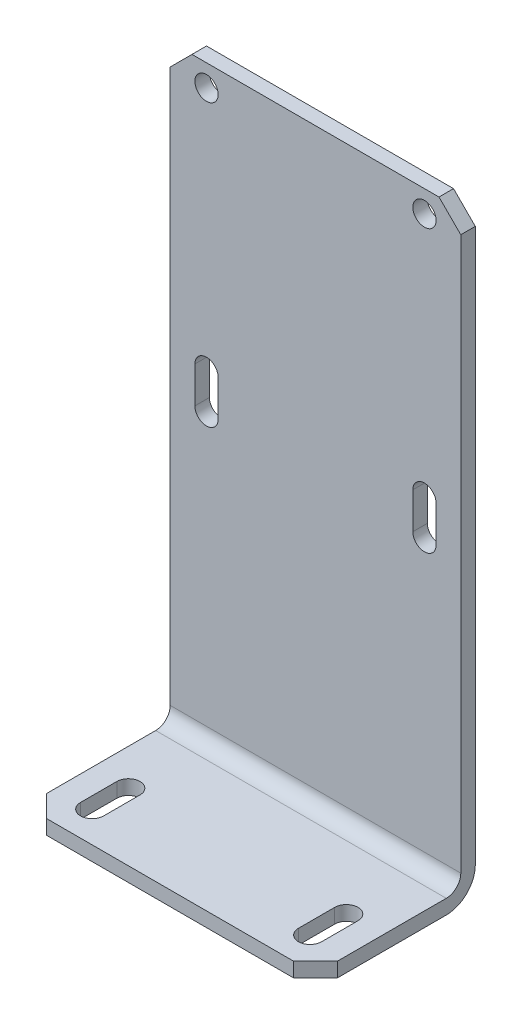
from build123d import *

# Parameters (mm, degrees)
ESQUISSE3_W             = 40
ESQUISSE3_H             = 83.1
BASE_EXTRUSION_DEPTH    = 2
ESQUISSE4_W             = 40
ESQUISSE4_H             = 2
BOSS_EXTRU_1_DEPTH      = 20
CONG_1_R                = 2
CONG_2_R                = 4
ESQUISSE5_R             = 1.6
ENL_V_MAT_EXTRU_1_DEPTH = 95.369539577
ENL_V_MAT_EXTRU_2_DEPTH = 95.369539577
ENL_V_MAT_EXTRU_3_DEPTH = 94.065622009
CHANFREIN1_SIZE         = 3


with BuildPart() as part:
    # Esquisse3 → Base-Extrusion (new body)
    with BuildSketch(Plane.XY):
        with Locations((20, 41.55)):
            Rectangle(ESQUISSE3_W, ESQUISSE3_H)
    extrude(amount=BASE_EXTRUSION_DEPTH)

    # Esquisse4 → Boss.-Extru.1 (add)
    with BuildSketch(Plane.XY.offset(2)):
        with Locations((20, 1)):
            Rectangle(ESQUISSE4_W, ESQUISSE4_H)
    extrude(amount=BOSS_EXTRU_1_DEPTH)

    # Cong_1
    cong_1_edges = [part.edges().sort_by_distance(p)[0] for p in [
        (20, 2, 2),
    ]]
    fillet(cong_1_edges, radius=CONG_1_R)

    # Cong_2
    cong_2_edges = [part.edges().sort_by_distance(p)[0] for p in [
        (20, 0, 0),
    ]]
    fillet(cong_2_edges, radius=CONG_2_R)

    # Esquisse5 → Enl_v. mat.-Extru.1 (cut, through all)
    with BuildSketch(Plane.XY.offset(2)):
        with Locations((5, 80.1)):
            Circle(ESQUISSE5_R)
    enl_v_mat_extru_1 = extrude(amount=-ENL_V_MAT_EXTRU_1_DEPTH, mode=Mode.SUBTRACT)

    # Sym_trie1: Enl_v. mat.-Extru.1 across plane
    add(enl_v_mat_extru_1.mirror(Plane(origin=(20, 0, 0), x_dir=(0, 0, 1), z_dir=(1, 0, 0))), mode=Mode.SUBTRACT)

    # Esquisse6 → Enl_v. mat.-Extru.2 (cut, through all)
    with BuildSketch(Plane.XY.offset(2)):
        with BuildLine():
            Line((3.4, 46.4), (3.4, 41.4))
            ThreePointArc((3.4, 41.4), (5, 39.8), (6.6, 41.4))
            Line((6.6, 41.4), (6.6, 46.4))
            ThreePointArc((6.6, 46.4), (5, 48), (3.4, 46.4))
        make_face()
    enl_v_mat_extru_2 = extrude(amount=-ENL_V_MAT_EXTRU_2_DEPTH, mode=Mode.SUBTRACT)

    # Sym_trie2: Enl_v. mat.-Extru.2 across plane
    add(enl_v_mat_extru_2.mirror(Plane(origin=(20, 0, 0), x_dir=(0, 0, 1), z_dir=(1, 0, 0))), mode=Mode.SUBTRACT)

    # Esquisse7 → Enl_v. mat.-Extru.3 (cut, through all)
    with BuildSketch(Plane(origin=(0, 2, 0), x_dir=(-1, 0, 0), z_dir=(0, 1, 0))):
        with BuildLine():
            Line((-3.4, 17.75), (-3.4, 12.75))
            ThreePointArc((-3.4, 12.75), (-5, 11.15), (-6.6, 12.75))
            Line((-6.6, 12.75), (-6.6, 17.75))
            ThreePointArc((-6.6, 17.75), (-5, 19.35), (-3.4, 17.75))
        make_face()
    enl_v_mat_extru_3 = extrude(amount=-ENL_V_MAT_EXTRU_3_DEPTH, mode=Mode.SUBTRACT)

    # Sym_trie3: Enl_v. mat.-Extru.3 across plane
    add(enl_v_mat_extru_3.mirror(Plane(origin=(20, 0, 0), x_dir=(0, 0, 1), z_dir=(1, 0, 0))), mode=Mode.SUBTRACT)

    # Chanfrein1
    chanfrein1_edges = [part.edges().sort_by_distance(p)[0] for p in [
        (0, 83.1, 1),
        (0, 1, 22),
        (40, 83.1, 1),
        (40, 1, 22),
    ]]
    chamfer(chanfrein1_edges, length=CHANFREIN1_SIZE)


solid = part.part
